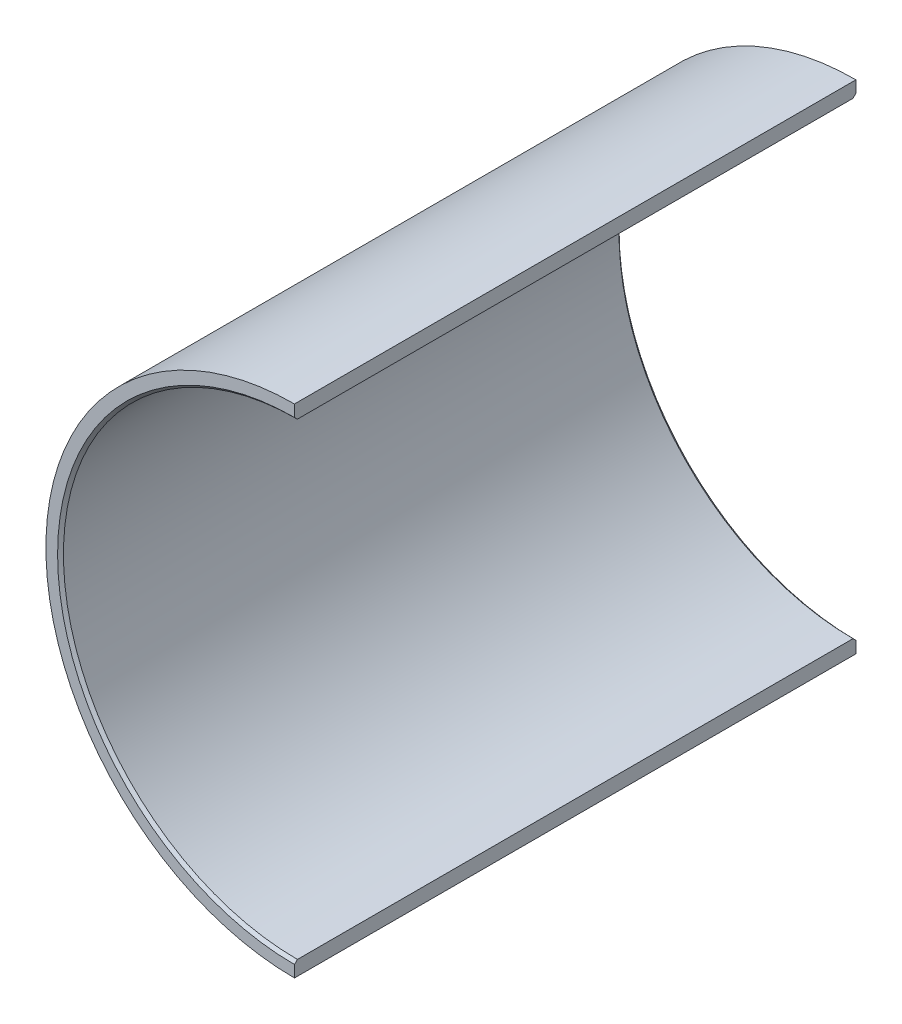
ISO-10303-21;
HEADER;
FILE_DESCRIPTION(('STEP AP214'),'2;1');
FILE_NAME('part.step','',(''),(''),'','','');
FILE_SCHEMA(('AUTOMOTIVE_DESIGN { 1 0 10303 214 1 1 1 1 }'));
ENDSEC;
DATA;
#1=APPLICATION_CONTEXT('core data for automotive mechanical design processes');
#2=APPLICATION_PROTOCOL_DEFINITION('international standard','automotive_design',2000,#1);
#3=PRODUCT_CONTEXT('',#1,'mechanical');
#4=PRODUCT('Part','Part','',(#3));
#5=PRODUCT_RELATED_PRODUCT_CATEGORY('part','',(#4));
#6=PRODUCT_DEFINITION_FORMATION('','',#4);
#7=PRODUCT_DEFINITION_CONTEXT('part definition',#1,'design');
#8=PRODUCT_DEFINITION('design','',#6,#7);
#9=PRODUCT_DEFINITION_SHAPE('','',#8);
#10=(LENGTH_UNIT() NAMED_UNIT(*) SI_UNIT(.MILLI.,.METRE.));
#11=(NAMED_UNIT(*) PLANE_ANGLE_UNIT() SI_UNIT($,.RADIAN.));
#12=(NAMED_UNIT(*) SI_UNIT($,.STERADIAN.) SOLID_ANGLE_UNIT());
#13=UNCERTAINTY_MEASURE_WITH_UNIT(LENGTH_MEASURE(1.E-05),#10,'distance_accuracy_value','');
#14=(GEOMETRIC_REPRESENTATION_CONTEXT(3) GLOBAL_UNCERTAINTY_ASSIGNED_CONTEXT((#13)) GLOBAL_UNIT_ASSIGNED_CONTEXT((#10,
#11,#12)) REPRESENTATION_CONTEXT('',''));
#15=CARTESIAN_POINT('',(0.,0.,0.));
#16=DIRECTION('',(0.,0.,1.));
#17=DIRECTION('',(1.,0.,0.));
#18=AXIS2_PLACEMENT_3D('',#15,#16,#17);
#19=CARTESIAN_POINT('',(0.,0.,-96.));
#20=DIRECTION('',(0.,0.,1.));
#21=DIRECTION('',(1.,0.,0.));
#22=AXIS2_PLACEMENT_3D('',#19,#20,#21);
#23=CYLINDRICAL_SURFACE('',#22,42.5);
#24=CARTESIAN_POINT('',(0.,0.,0.));
#25=DIRECTION('',(0.,0.,1.));
#26=DIRECTION('',(1.,0.,0.));
#27=AXIS2_PLACEMENT_3D('',#24,#25,#26);
#28=CIRCLE('',#27,42.5);
#29=CARTESIAN_POINT('',(0.,42.5000000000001,0.));
#30=VERTEX_POINT('',#29);
#31=CARTESIAN_POINT('',(0.,-42.5,0.));
#32=VERTEX_POINT('',#31);
#33=EDGE_CURVE('E113',#30,#32,#28,.T.);
#34=ORIENTED_EDGE('',*,*,#33,.F.);
#35=DIRECTION('',(0.,0.,1.));
#36=VECTOR('',#35,1.);
#37=CARTESIAN_POINT('',(0.,42.5000000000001,-96.));
#38=LINE('',#37,#36);
#39=CARTESIAN_POINT('',(0.,42.5000000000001,-96.));
#40=VERTEX_POINT('',#39);
#41=EDGE_CURVE('E99',#30,#40,#38,.F.);
#42=ORIENTED_EDGE('',*,*,#41,.T.);
#43=CARTESIAN_POINT('',(0.,0.,-96.));
#44=DIRECTION('',(0.,0.,1.));
#45=DIRECTION('',(1.,0.,0.));
#46=AXIS2_PLACEMENT_3D('',#43,#44,#45);
#47=CIRCLE('',#46,42.5);
#48=CARTESIAN_POINT('',(0.,-42.5,-95.9999999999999));
#49=VERTEX_POINT('',#48);
#50=EDGE_CURVE('E98',#40,#49,#47,.T.);
#51=ORIENTED_EDGE('',*,*,#50,.T.);
#52=DIRECTION('',(0.,0.,1.));
#53=VECTOR('',#52,1.);
#54=CARTESIAN_POINT('',(0.,-42.5,-95.9999999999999));
#55=LINE('',#54,#53);
#56=EDGE_CURVE('E120',#49,#32,#55,.T.);
#57=ORIENTED_EDGE('',*,*,#56,.T.);
#58=EDGE_LOOP('',(#34,#42,#51,#57));
#59=FACE_BOUND('',#58,.T.);
#60=ADVANCED_FACE('F36',(#59),#23,.T.);
#61=CARTESIAN_POINT('',(0.,0.,-96.));
#62=DIRECTION('',(0.,0.,1.));
#63=DIRECTION('',(1.,0.,0.));
#64=AXIS2_PLACEMENT_3D('',#61,#62,#63);
#65=PLANE('',#64);
#66=DIRECTION('',(0.,1.,0.));
#67=VECTOR('',#66,1.);
#68=CARTESIAN_POINT('',(0.,0.,-96.));
#69=LINE('',#68,#67);
#70=CARTESIAN_POINT('',(0.,-40.5000000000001,-96.));
#71=VERTEX_POINT('',#70);
#72=EDGE_CURVE('E50',#49,#71,#69,.T.);
#73=ORIENTED_EDGE('',*,*,#72,.F.);
#74=ORIENTED_EDGE('',*,*,#50,.F.);
#75=CARTESIAN_POINT('',(0.,40.5000000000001,-96.));
#76=VERTEX_POINT('',#75);
#77=EDGE_CURVE('E86',#76,#40,#69,.T.);
#78=ORIENTED_EDGE('',*,*,#77,.F.);
#79=CARTESIAN_POINT('',(0.,0.,-96.));
#80=DIRECTION('',(0.,0.,1.));
#81=DIRECTION('',(1.,0.,0.));
#82=AXIS2_PLACEMENT_3D('',#79,#80,#81);
#83=CIRCLE('',#82,40.5);
#84=EDGE_CURVE('E92',#76,#71,#83,.T.);
#85=ORIENTED_EDGE('',*,*,#84,.T.);
#86=EDGE_LOOP('',(#73,#74,#78,#85));
#87=FACE_BOUND('',#86,.T.);
#88=ADVANCED_FACE('F96',(#87),#65,.F.);
#89=CARTESIAN_POINT('',(0.,0.,0.));
#90=DIRECTION('',(0.,0.,1.));
#91=DIRECTION('',(1.,0.,0.));
#92=AXIS2_PLACEMENT_3D('',#89,#90,#91);
#93=PLANE('',#92);
#94=ORIENTED_EDGE('',*,*,#33,.T.);
#95=DIRECTION('',(0.,1.,0.));
#96=VECTOR('',#95,1.);
#97=CARTESIAN_POINT('',(0.,0.,0.));
#98=LINE('',#97,#96);
#99=CARTESIAN_POINT('',(0.,-40.5000000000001,0.));
#100=VERTEX_POINT('',#99);
#101=EDGE_CURVE('E116',#32,#100,#98,.T.);
#102=ORIENTED_EDGE('',*,*,#101,.T.);
#103=CARTESIAN_POINT('',(0.,0.,0.));
#104=DIRECTION('',(0.,0.,1.));
#105=DIRECTION('',(1.,0.,0.));
#106=AXIS2_PLACEMENT_3D('',#103,#104,#105);
#107=CIRCLE('',#106,40.5);
#108=CARTESIAN_POINT('',(0.,40.5000000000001,0.));
#109=VERTEX_POINT('',#108);
#110=EDGE_CURVE('E102',#100,#109,#107,.F.);
#111=ORIENTED_EDGE('',*,*,#110,.T.);
#112=EDGE_CURVE('E125',#109,#30,#98,.T.);
#113=ORIENTED_EDGE('',*,*,#112,.T.);
#114=EDGE_LOOP('',(#94,#102,#111,#113));
#115=FACE_BOUND('',#114,.T.);
#116=ADVANCED_FACE('F135',(#115),#93,.T.);
#117=CARTESIAN_POINT('',(0.,0.,-96.));
#118=DIRECTION('',(0.,0.,1.));
#119=DIRECTION('',(1.,0.,0.));
#120=AXIS2_PLACEMENT_3D('',#117,#118,#119);
#121=CYLINDRICAL_SURFACE('',#120,40.);
#122=DIRECTION('',(0.,0.,1.));
#123=VECTOR('',#122,1.);
#124=CARTESIAN_POINT('',(0.,40.,-96.));
#125=LINE('',#124,#123);
#126=CARTESIAN_POINT('',(0.,40.,-0.5));
#127=VERTEX_POINT('',#126);
#128=CARTESIAN_POINT('',(0.,40.,-95.5));
#129=VERTEX_POINT('',#128);
#130=EDGE_CURVE('E57',#127,#129,#125,.F.);
#131=ORIENTED_EDGE('',*,*,#130,.F.);
#132=CARTESIAN_POINT('',(0.,0.,-0.5));
#133=DIRECTION('',(0.,0.,1.));
#134=DIRECTION('',(1.,0.,0.));
#135=AXIS2_PLACEMENT_3D('',#132,#133,#134);
#136=CIRCLE('',#135,40.);
#137=CARTESIAN_POINT('',(0.,-40.,-0.5));
#138=VERTEX_POINT('',#137);
#139=EDGE_CURVE('E105',#127,#138,#136,.T.);
#140=ORIENTED_EDGE('',*,*,#139,.T.);
#141=DIRECTION('',(0.,0.,1.));
#142=VECTOR('',#141,1.);
#143=CARTESIAN_POINT('',(0.,-39.9999999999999,-96.));
#144=LINE('',#143,#142);
#145=CARTESIAN_POINT('',(0.,-40.,-95.5));
#146=VERTEX_POINT('',#145);
#147=EDGE_CURVE('E123',#146,#138,#144,.T.);
#148=ORIENTED_EDGE('',*,*,#147,.F.);
#149=CARTESIAN_POINT('',(0.,0.,-95.5));
#150=DIRECTION('',(0.,0.,1.));
#151=DIRECTION('',(1.,0.,0.));
#152=AXIS2_PLACEMENT_3D('',#149,#150,#151);
#153=CIRCLE('',#152,40.);
#154=EDGE_CURVE('E110',#146,#129,#153,.F.);
#155=ORIENTED_EDGE('',*,*,#154,.T.);
#156=EDGE_LOOP('',(#131,#140,#148,#155));
#157=FACE_BOUND('',#156,.T.);
#158=ADVANCED_FACE('F142',(#157),#121,.F.);
#159=CARTESIAN_POINT('',(0.,0.,-0.5));
#160=DIRECTION('',(0.,0.,1.));
#161=DIRECTION('',(1.,0.,0.));
#162=AXIS2_PLACEMENT_3D('',#159,#160,#161);
#163=CONICAL_SURFACE('',#162,40.,0.785398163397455);
#164=ORIENTED_EDGE('',*,*,#139,.F.);
#165=DIRECTION('',(0.,0.707106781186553,0.707106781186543));
#166=VECTOR('',#165,1.);
#167=CARTESIAN_POINT('',(0.,0.,-40.4999999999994));
#168=LINE('',#167,#166);
#169=EDGE_CURVE('E128',#127,#109,#168,.T.);
#170=ORIENTED_EDGE('',*,*,#169,.T.);
#171=ORIENTED_EDGE('',*,*,#110,.F.);
#172=DIRECTION('',(0.,0.707106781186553,-0.707106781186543));
#173=VECTOR('',#172,1.);
#174=CARTESIAN_POINT('',(0.,0.,-40.4999999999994));
#175=LINE('',#174,#173);
#176=EDGE_CURVE('E117',#100,#138,#175,.T.);
#177=ORIENTED_EDGE('',*,*,#176,.T.);
#178=EDGE_LOOP('',(#164,#170,#171,#177));
#179=FACE_BOUND('',#178,.T.);
#180=ADVANCED_FACE('F140',(#179),#163,.F.);
#181=CARTESIAN_POINT('',(0.,0.,-96.));
#182=DIRECTION('',(0.,0.,-1.));
#183=DIRECTION('',(-1.,0.,0.));
#184=AXIS2_PLACEMENT_3D('',#181,#182,#183);
#185=CONICAL_SURFACE('',#184,40.5,0.785398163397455);
#186=ORIENTED_EDGE('',*,*,#154,.F.);
#187=DIRECTION('',(0.,-0.707106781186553,-0.707106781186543));
#188=VECTOR('',#187,1.);
#189=CARTESIAN_POINT('',(0.,0.,-55.5000000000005));
#190=LINE('',#189,#188);
#191=EDGE_CURVE('E13',#146,#71,#190,.T.);
#192=ORIENTED_EDGE('',*,*,#191,.T.);
#193=ORIENTED_EDGE('',*,*,#84,.F.);
#194=DIRECTION('',(0.,-0.707106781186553,0.707106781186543));
#195=VECTOR('',#194,1.);
#196=CARTESIAN_POINT('',(0.,0.,-55.5000000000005));
#197=LINE('',#196,#195);
#198=EDGE_CURVE('E43',#76,#129,#197,.T.);
#199=ORIENTED_EDGE('',*,*,#198,.T.);
#200=EDGE_LOOP('',(#186,#192,#193,#199));
#201=FACE_BOUND('',#200,.T.);
#202=ADVANCED_FACE('F101',(#201),#185,.F.);
#203=CARTESIAN_POINT('',(0.,80.,9.9999999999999));
#204=DIRECTION('',(1.,0.,0.));
#205=DIRECTION('',(0.,0.,-1.));
#206=AXIS2_PLACEMENT_3D('',#203,#204,#205);
#207=PLANE('',#206);
#208=ORIENTED_EDGE('',*,*,#169,.F.);
#209=ORIENTED_EDGE('',*,*,#130,.T.);
#210=ORIENTED_EDGE('',*,*,#198,.F.);
#211=ORIENTED_EDGE('',*,*,#77,.T.);
#212=ORIENTED_EDGE('',*,*,#41,.F.);
#213=ORIENTED_EDGE('',*,*,#112,.F.);
#214=EDGE_LOOP('',(#208,#209,#210,#211,#212,#213));
#215=FACE_BOUND('',#214,.T.);
#216=ADVANCED_FACE('F85',(#215),#207,.T.);
#217=ORIENTED_EDGE('',*,*,#56,.F.);
#218=ORIENTED_EDGE('',*,*,#72,.T.);
#219=ORIENTED_EDGE('',*,*,#191,.F.);
#220=ORIENTED_EDGE('',*,*,#147,.T.);
#221=ORIENTED_EDGE('',*,*,#176,.F.);
#222=ORIENTED_EDGE('',*,*,#101,.F.);
#223=EDGE_LOOP('',(#217,#218,#219,#220,#221,#222));
#224=FACE_BOUND('',#223,.T.);
#225=ADVANCED_FACE('F144',(#224),#207,.T.);
#226=CLOSED_SHELL('',(#60,#88,#116,#158,#180,#202,#216,#225));
#227=MANIFOLD_SOLID_BREP('B2',#226);
#228=ADVANCED_BREP_SHAPE_REPRESENTATION('',(#18,#227),#14);
#229=SHAPE_DEFINITION_REPRESENTATION(#9,#228);
ENDSEC;
END-ISO-10303-21;
